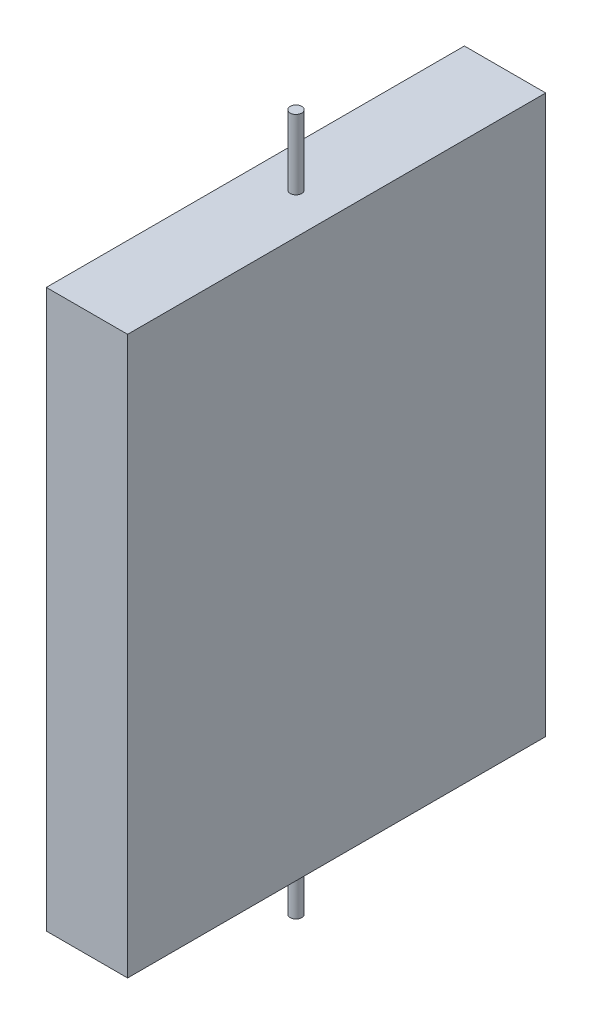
from build123d import *

# Parameters (mm, degrees)
BOSS_EXTRUDE1_DEPTH      = 175
BOSS_EXTRUDE1_DEPTH_BACK = 175
SKETCH1_W                = 2400
SKETCH1_H                = 1800
BOSS_EXTRUDE2_DEPTH      = 1500
BOSS_EXTRUDE2_DEPTH_BACK = 1500
SKETCH2_R                = 25


with BuildPart() as part:
    # Sketch1 → Boss-Extrude1 (new, two sides: drawn at the far end of the back side and taken through both)
    with BuildSketch(Plane.YZ.offset(-BOSS_EXTRUDE1_DEPTH_BACK)):
        Rectangle(SKETCH1_W, SKETCH1_H)
    extrude(amount=BOSS_EXTRUDE1_DEPTH + BOSS_EXTRUDE1_DEPTH_BACK)

    # Sketch2 → Boss-Extrude2 (add, two sides: drawn at the far end of the back side and taken through both)
    with BuildSketch(Plane(origin=(0, 0, 0), x_dir=(1, 0, 0), z_dir=(0, 1, 0)).offset(-BOSS_EXTRUDE2_DEPTH_BACK)):
        with Locations(Location((0, 0, 0), (0, 0, 270))):
            Circle(SKETCH2_R)
    extrude(amount=BOSS_EXTRUDE2_DEPTH + BOSS_EXTRUDE2_DEPTH_BACK)


solid = part.part
